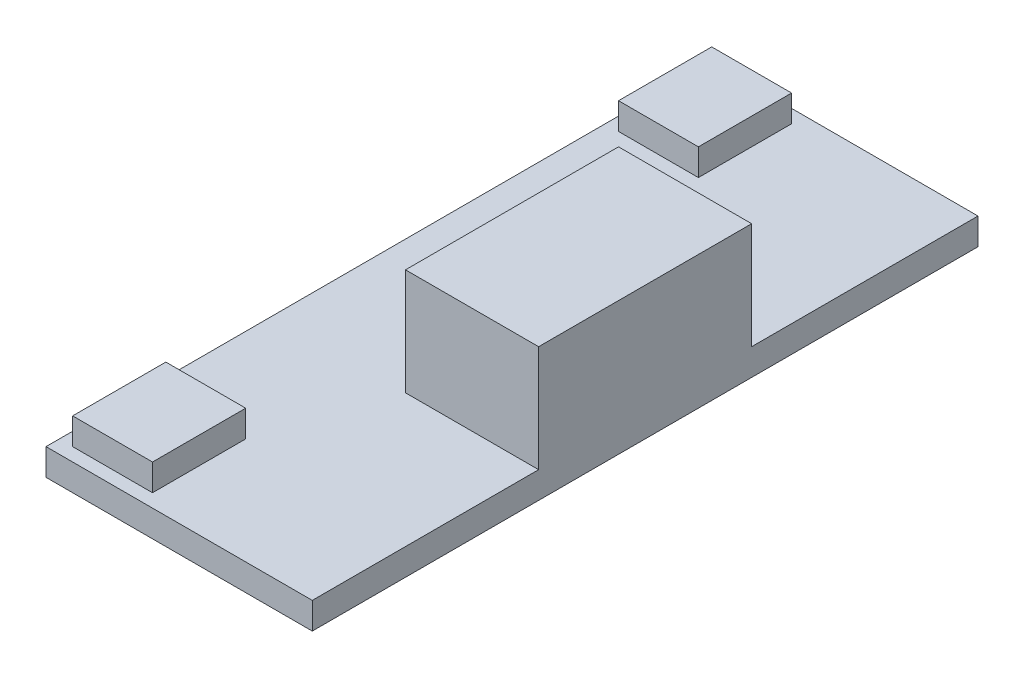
ISO-10303-21;
HEADER;
FILE_DESCRIPTION(('STEP AP214'),'2;1');
FILE_NAME('part.step','',(''),(''),'','','');
FILE_SCHEMA(('AUTOMOTIVE_DESIGN { 1 0 10303 214 1 1 1 1 }'));
ENDSEC;
DATA;
#1=APPLICATION_CONTEXT('core data for automotive mechanical design processes');
#2=APPLICATION_PROTOCOL_DEFINITION('international standard','automotive_design',2000,#1);
#3=PRODUCT_CONTEXT('',#1,'mechanical');
#4=PRODUCT('Part','Part','',(#3));
#5=PRODUCT_RELATED_PRODUCT_CATEGORY('part','',(#4));
#6=PRODUCT_DEFINITION_FORMATION('','',#4);
#7=PRODUCT_DEFINITION_CONTEXT('part definition',#1,'design');
#8=PRODUCT_DEFINITION('design','',#6,#7);
#9=PRODUCT_DEFINITION_SHAPE('','',#8);
#10=(LENGTH_UNIT() NAMED_UNIT(*) SI_UNIT(.MILLI.,.METRE.));
#11=(NAMED_UNIT(*) PLANE_ANGLE_UNIT() SI_UNIT($,.RADIAN.));
#12=(NAMED_UNIT(*) SI_UNIT($,.STERADIAN.) SOLID_ANGLE_UNIT());
#13=UNCERTAINTY_MEASURE_WITH_UNIT(LENGTH_MEASURE(1.E-05),#10,'distance_accuracy_value','');
#14=(GEOMETRIC_REPRESENTATION_CONTEXT(3) GLOBAL_UNCERTAINTY_ASSIGNED_CONTEXT((#13)) GLOBAL_UNIT_ASSIGNED_CONTEXT((#10,
#11,#12)) REPRESENTATION_CONTEXT('',''));
#15=CARTESIAN_POINT('',(0.,0.,0.));
#16=DIRECTION('',(0.,0.,1.));
#17=DIRECTION('',(1.,0.,0.));
#18=AXIS2_PLACEMENT_3D('',#15,#16,#17);
#19=CARTESIAN_POINT('',(0.,1.,0.));
#20=DIRECTION('',(0.,1.,0.));
#21=DIRECTION('',(0.,0.,1.));
#22=AXIS2_PLACEMENT_3D('',#19,#20,#21);
#23=PLANE('',#22);
#24=DIRECTION('',(1.,0.,0.));
#25=VECTOR('',#24,1.);
#26=CARTESIAN_POINT('',(0.,1.,-12.));
#27=LINE('',#26,#25);
#28=CARTESIAN_POINT('',(-4.5,1.,-12.));
#29=VERTEX_POINT('',#28);
#30=CARTESIAN_POINT('',(-1.5,1.,-12.));
#31=VERTEX_POINT('',#30);
#32=EDGE_CURVE('E150',#29,#31,#27,.T.);
#33=ORIENTED_EDGE('',*,*,#32,.T.);
#34=DIRECTION('',(0.,0.,1.));
#35=VECTOR('',#34,1.);
#36=CARTESIAN_POINT('',(-1.5,1.,0.));
#37=LINE('',#36,#35);
#38=CARTESIAN_POINT('',(-1.5,1.,-8.5));
#39=VERTEX_POINT('',#38);
#40=EDGE_CURVE('E166',#31,#39,#37,.T.);
#41=ORIENTED_EDGE('',*,*,#40,.T.);
#42=DIRECTION('',(1.,0.,0.));
#43=VECTOR('',#42,1.);
#44=CARTESIAN_POINT('',(0.,1.,-8.5));
#45=LINE('',#44,#43);
#46=CARTESIAN_POINT('',(-4.5,1.,-8.5));
#47=VERTEX_POINT('',#46);
#48=EDGE_CURVE('E52',#47,#39,#45,.T.);
#49=ORIENTED_EDGE('',*,*,#48,.F.);
#50=DIRECTION('',(0.,0.,1.));
#51=VECTOR('',#50,1.);
#52=CARTESIAN_POINT('',(-4.5,1.,0.));
#53=LINE('',#52,#51);
#54=EDGE_CURVE('E47',#29,#47,#53,.T.);
#55=ORIENTED_EDGE('',*,*,#54,.F.);
#56=EDGE_LOOP('',(#33,#41,#49,#55));
#57=FACE_BOUND('',#56,.T.);
#58=DIRECTION('',(1.,0.,0.));
#59=VECTOR('',#58,1.);
#60=CARTESIAN_POINT('',(0.,1.,4.));
#61=LINE('',#60,#59);
#62=CARTESIAN_POINT('',(0.,1.,4.));
#63=VERTEX_POINT('',#62);
#64=CARTESIAN_POINT('',(5.,1.,4.));
#65=VERTEX_POINT('',#64);
#66=EDGE_CURVE('E213',#63,#65,#61,.T.);
#67=ORIENTED_EDGE('',*,*,#66,.F.);
#68=DIRECTION('',(0.,0.,1.));
#69=VECTOR('',#68,1.);
#70=CARTESIAN_POINT('',(0.,1.,-4.));
#71=LINE('',#70,#69);
#72=CARTESIAN_POINT('',(0.,1.,-4.));
#73=VERTEX_POINT('',#72);
#74=EDGE_CURVE('E217',#73,#63,#71,.T.);
#75=ORIENTED_EDGE('',*,*,#74,.F.);
#76=DIRECTION('',(1.,0.,0.));
#77=VECTOR('',#76,1.);
#78=CARTESIAN_POINT('',(0.,1.,-4.));
#79=LINE('',#78,#77);
#80=CARTESIAN_POINT('',(5.,1.,-4.));
#81=VERTEX_POINT('',#80);
#82=EDGE_CURVE('E228',#73,#81,#79,.T.);
#83=ORIENTED_EDGE('',*,*,#82,.T.);
#84=DIRECTION('',(0.,0.,-1.));
#85=VECTOR('',#84,1.);
#86=CARTESIAN_POINT('',(5.,1.,12.5));
#87=LINE('',#86,#85);
#88=CARTESIAN_POINT('',(5.,1.,-12.5));
#89=VERTEX_POINT('',#88);
#90=EDGE_CURVE('E247',#81,#89,#87,.T.);
#91=ORIENTED_EDGE('',*,*,#90,.T.);
#92=DIRECTION('',(-1.,0.,0.));
#93=VECTOR('',#92,1.);
#94=CARTESIAN_POINT('',(5.,1.,-12.5));
#95=LINE('',#94,#93);
#96=CARTESIAN_POINT('',(-5.,1.,-12.5));
#97=VERTEX_POINT('',#96);
#98=EDGE_CURVE('E251',#89,#97,#95,.T.);
#99=ORIENTED_EDGE('',*,*,#98,.T.);
#100=DIRECTION('',(0.,0.,1.));
#101=VECTOR('',#100,1.);
#102=CARTESIAN_POINT('',(-5.,1.,12.5));
#103=LINE('',#102,#101);
#104=CARTESIAN_POINT('',(-5.,1.,12.5));
#105=VERTEX_POINT('',#104);
#106=EDGE_CURVE('E241',#97,#105,#103,.T.);
#107=ORIENTED_EDGE('',*,*,#106,.T.);
#108=DIRECTION('',(1.,0.,0.));
#109=VECTOR('',#108,1.);
#110=CARTESIAN_POINT('',(5.,1.,12.5));
#111=LINE('',#110,#109);
#112=CARTESIAN_POINT('',(5.,1.,12.5));
#113=VERTEX_POINT('',#112);
#114=EDGE_CURVE('E244',#105,#113,#111,.T.);
#115=ORIENTED_EDGE('',*,*,#114,.T.);
#116=EDGE_CURVE('E248',#113,#65,#87,.T.);
#117=ORIENTED_EDGE('',*,*,#116,.T.);
#118=EDGE_LOOP('',(#67,#75,#83,#91,#99,#107,#115,#117));
#119=FACE_BOUND('',#118,.T.);
#120=DIRECTION('',(0.,0.,-1.));
#121=VECTOR('',#120,1.);
#122=CARTESIAN_POINT('',(-1.5,1.,0.));
#123=LINE('',#122,#121);
#124=CARTESIAN_POINT('',(-1.5,1.,12.));
#125=VERTEX_POINT('',#124);
#126=CARTESIAN_POINT('',(-1.5,1.,8.5));
#127=VERTEX_POINT('',#126);
#128=EDGE_CURVE('E196',#125,#127,#123,.T.);
#129=ORIENTED_EDGE('',*,*,#128,.F.);
#130=DIRECTION('',(1.,0.,0.));
#131=VECTOR('',#130,1.);
#132=CARTESIAN_POINT('',(0.,1.,12.));
#133=LINE('',#132,#131);
#134=CARTESIAN_POINT('',(-4.5,1.,12.));
#135=VERTEX_POINT('',#134);
#136=EDGE_CURVE('E152',#135,#125,#133,.T.);
#137=ORIENTED_EDGE('',*,*,#136,.F.);
#138=DIRECTION('',(0.,0.,-1.));
#139=VECTOR('',#138,1.);
#140=CARTESIAN_POINT('',(-4.5,1.,0.));
#141=LINE('',#140,#139);
#142=CARTESIAN_POINT('',(-4.5,1.,8.5));
#143=VERTEX_POINT('',#142);
#144=EDGE_CURVE('E185',#135,#143,#141,.T.);
#145=ORIENTED_EDGE('',*,*,#144,.T.);
#146=DIRECTION('',(1.,0.,0.));
#147=VECTOR('',#146,1.);
#148=CARTESIAN_POINT('',(0.,1.,8.5));
#149=LINE('',#148,#147);
#150=EDGE_CURVE('E199',#143,#127,#149,.T.);
#151=ORIENTED_EDGE('',*,*,#150,.T.);
#152=EDGE_LOOP('',(#129,#137,#145,#151));
#153=FACE_BOUND('',#152,.T.);
#154=ADVANCED_FACE('F32',(#57,#119,#153),#23,.T.);
#155=CARTESIAN_POINT('',(-5.,1.,12.5));
#156=DIRECTION('',(1.,0.,0.));
#157=DIRECTION('',(0.,0.,-1.));
#158=AXIS2_PLACEMENT_3D('',#155,#156,#157);
#159=PLANE('',#158);
#160=DIRECTION('',(0.,0.,1.));
#161=VECTOR('',#160,1.);
#162=CARTESIAN_POINT('',(-5.,0.,12.5));
#163=LINE('',#162,#161);
#164=CARTESIAN_POINT('',(-5.,0.,-12.5));
#165=VERTEX_POINT('',#164);
#166=CARTESIAN_POINT('',(-5.,0.,12.5));
#167=VERTEX_POINT('',#166);
#168=EDGE_CURVE('E240',#165,#167,#163,.T.);
#169=ORIENTED_EDGE('',*,*,#168,.T.);
#170=DIRECTION('',(0.,-1.,0.));
#171=VECTOR('',#170,1.);
#172=CARTESIAN_POINT('',(-5.,1.,12.5));
#173=LINE('',#172,#171);
#174=EDGE_CURVE('E11',#105,#167,#173,.T.);
#175=ORIENTED_EDGE('',*,*,#174,.F.);
#176=ORIENTED_EDGE('',*,*,#106,.F.);
#177=DIRECTION('',(0.,-1.,0.));
#178=VECTOR('',#177,1.);
#179=CARTESIAN_POINT('',(-5.,1.,-12.5));
#180=LINE('',#179,#178);
#181=EDGE_CURVE('E253',#97,#165,#180,.T.);
#182=ORIENTED_EDGE('',*,*,#181,.T.);
#183=EDGE_LOOP('',(#169,#175,#176,#182));
#184=FACE_BOUND('',#183,.T.);
#185=ADVANCED_FACE('F34',(#184),#159,.F.);
#186=CARTESIAN_POINT('',(5.,1.,12.5));
#187=DIRECTION('',(0.,0.,-1.));
#188=DIRECTION('',(-1.,0.,0.));
#189=AXIS2_PLACEMENT_3D('',#186,#187,#188);
#190=PLANE('',#189);
#191=DIRECTION('',(1.,0.,0.));
#192=VECTOR('',#191,1.);
#193=CARTESIAN_POINT('',(5.,0.,12.5));
#194=LINE('',#193,#192);
#195=CARTESIAN_POINT('',(5.,0.,12.5));
#196=VERTEX_POINT('',#195);
#197=EDGE_CURVE('E256',#167,#196,#194,.T.);
#198=ORIENTED_EDGE('',*,*,#197,.T.);
#199=DIRECTION('',(0.,-1.,0.));
#200=VECTOR('',#199,1.);
#201=CARTESIAN_POINT('',(5.,1.,12.5));
#202=LINE('',#201,#200);
#203=EDGE_CURVE('E40',#113,#196,#202,.T.);
#204=ORIENTED_EDGE('',*,*,#203,.F.);
#205=ORIENTED_EDGE('',*,*,#114,.F.);
#206=ORIENTED_EDGE('',*,*,#174,.T.);
#207=EDGE_LOOP('',(#198,#204,#205,#206));
#208=FACE_BOUND('',#207,.T.);
#209=ADVANCED_FACE('F317',(#208),#190,.F.);
#210=CARTESIAN_POINT('',(5.,1.,12.5));
#211=DIRECTION('',(-1.,0.,0.));
#212=DIRECTION('',(0.,0.,1.));
#213=AXIS2_PLACEMENT_3D('',#210,#211,#212);
#214=PLANE('',#213);
#215=DIRECTION('',(0.,0.,-1.));
#216=VECTOR('',#215,1.);
#217=CARTESIAN_POINT('',(5.,0.,12.5));
#218=LINE('',#217,#216);
#219=CARTESIAN_POINT('',(5.,0.,-12.5));
#220=VERTEX_POINT('',#219);
#221=EDGE_CURVE('E258',#196,#220,#218,.T.);
#222=ORIENTED_EDGE('',*,*,#221,.T.);
#223=DIRECTION('',(0.,-1.,0.));
#224=VECTOR('',#223,1.);
#225=CARTESIAN_POINT('',(5.,1.,-12.5));
#226=LINE('',#225,#224);
#227=EDGE_CURVE('E263',#89,#220,#226,.T.);
#228=ORIENTED_EDGE('',*,*,#227,.F.);
#229=ORIENTED_EDGE('',*,*,#90,.F.);
#230=DIRECTION('',(0.,-1.,0.));
#231=VECTOR('',#230,1.);
#232=CARTESIAN_POINT('',(5.,5.,-4.));
#233=LINE('',#232,#231);
#234=CARTESIAN_POINT('',(5.,5.,-4.));
#235=VERTEX_POINT('',#234);
#236=EDGE_CURVE('E236',#235,#81,#233,.T.);
#237=ORIENTED_EDGE('',*,*,#236,.F.);
#238=DIRECTION('',(0.,0.,1.));
#239=VECTOR('',#238,1.);
#240=CARTESIAN_POINT('',(5.,5.,-4.));
#241=LINE('',#240,#239);
#242=CARTESIAN_POINT('',(5.,5.,4.));
#243=VERTEX_POINT('',#242);
#244=EDGE_CURVE('E216',#235,#243,#241,.T.);
#245=ORIENTED_EDGE('',*,*,#244,.T.);
#246=DIRECTION('',(0.,-1.,0.));
#247=VECTOR('',#246,1.);
#248=CARTESIAN_POINT('',(5.,5.,4.));
#249=LINE('',#248,#247);
#250=EDGE_CURVE('E238',#243,#65,#249,.T.);
#251=ORIENTED_EDGE('',*,*,#250,.T.);
#252=ORIENTED_EDGE('',*,*,#116,.F.);
#253=ORIENTED_EDGE('',*,*,#203,.T.);
#254=EDGE_LOOP('',(#222,#228,#229,#237,#245,#251,#252,#253));
#255=FACE_BOUND('',#254,.T.);
#256=ADVANCED_FACE('F270',(#255),#214,.F.);
#257=CARTESIAN_POINT('',(5.,1.,-12.5));
#258=DIRECTION('',(0.,0.,1.));
#259=DIRECTION('',(1.,0.,0.));
#260=AXIS2_PLACEMENT_3D('',#257,#258,#259);
#261=PLANE('',#260);
#262=DIRECTION('',(-1.,0.,0.));
#263=VECTOR('',#262,1.);
#264=CARTESIAN_POINT('',(5.,0.,-12.5));
#265=LINE('',#264,#263);
#266=EDGE_CURVE('E245',#220,#165,#265,.T.);
#267=ORIENTED_EDGE('',*,*,#266,.T.);
#268=ORIENTED_EDGE('',*,*,#181,.F.);
#269=ORIENTED_EDGE('',*,*,#98,.F.);
#270=ORIENTED_EDGE('',*,*,#227,.T.);
#271=EDGE_LOOP('',(#267,#268,#269,#270));
#272=FACE_BOUND('',#271,.T.);
#273=ADVANCED_FACE('F279',(#272),#261,.F.);
#274=CARTESIAN_POINT('',(0.,0.,0.));
#275=DIRECTION('',(0.,1.,0.));
#276=DIRECTION('',(0.,0.,1.));
#277=AXIS2_PLACEMENT_3D('',#274,#275,#276);
#278=PLANE('',#277);
#279=ORIENTED_EDGE('',*,*,#168,.F.);
#280=ORIENTED_EDGE('',*,*,#266,.F.);
#281=ORIENTED_EDGE('',*,*,#221,.F.);
#282=ORIENTED_EDGE('',*,*,#197,.F.);
#283=EDGE_LOOP('',(#279,#280,#281,#282));
#284=FACE_BOUND('',#283,.T.);
#285=ADVANCED_FACE('F276',(#284),#278,.F.);
#286=CARTESIAN_POINT('',(0.,5.,4.));
#287=DIRECTION('',(0.,0.,-1.));
#288=DIRECTION('',(-1.,0.,0.));
#289=AXIS2_PLACEMENT_3D('',#286,#287,#288);
#290=PLANE('',#289);
#291=ORIENTED_EDGE('',*,*,#66,.T.);
#292=ORIENTED_EDGE('',*,*,#250,.F.);
#293=DIRECTION('',(1.,0.,0.));
#294=VECTOR('',#293,1.);
#295=CARTESIAN_POINT('',(0.,5.,4.));
#296=LINE('',#295,#294);
#297=CARTESIAN_POINT('',(0.,5.,4.));
#298=VERTEX_POINT('',#297);
#299=EDGE_CURVE('E214',#298,#243,#296,.T.);
#300=ORIENTED_EDGE('',*,*,#299,.F.);
#301=DIRECTION('',(0.,-1.,0.));
#302=VECTOR('',#301,1.);
#303=CARTESIAN_POINT('',(0.,5.,4.));
#304=LINE('',#303,#302);
#305=EDGE_CURVE('E225',#298,#63,#304,.T.);
#306=ORIENTED_EDGE('',*,*,#305,.T.);
#307=EDGE_LOOP('',(#291,#292,#300,#306));
#308=FACE_BOUND('',#307,.T.);
#309=ADVANCED_FACE('F303',(#308),#290,.F.);
#310=CARTESIAN_POINT('',(0.,5.,-4.));
#311=DIRECTION('',(0.,0.,-1.));
#312=DIRECTION('',(-1.,0.,0.));
#313=AXIS2_PLACEMENT_3D('',#310,#311,#312);
#314=PLANE('',#313);
#315=ORIENTED_EDGE('',*,*,#82,.F.);
#316=DIRECTION('',(0.,-1.,0.));
#317=VECTOR('',#316,1.);
#318=CARTESIAN_POINT('',(0.,5.,-4.));
#319=LINE('',#318,#317);
#320=CARTESIAN_POINT('',(0.,5.,-4.));
#321=VERTEX_POINT('',#320);
#322=EDGE_CURVE('E234',#321,#73,#319,.T.);
#323=ORIENTED_EDGE('',*,*,#322,.F.);
#324=DIRECTION('',(1.,0.,0.));
#325=VECTOR('',#324,1.);
#326=CARTESIAN_POINT('',(0.,5.,-4.));
#327=LINE('',#326,#325);
#328=EDGE_CURVE('E220',#321,#235,#327,.T.);
#329=ORIENTED_EDGE('',*,*,#328,.T.);
#330=ORIENTED_EDGE('',*,*,#236,.T.);
#331=EDGE_LOOP('',(#315,#323,#329,#330));
#332=FACE_BOUND('',#331,.T.);
#333=ADVANCED_FACE('F297',(#332),#314,.T.);
#334=CARTESIAN_POINT('',(0.,5.,-4.));
#335=DIRECTION('',(1.,0.,0.));
#336=DIRECTION('',(0.,0.,-1.));
#337=AXIS2_PLACEMENT_3D('',#334,#335,#336);
#338=PLANE('',#337);
#339=ORIENTED_EDGE('',*,*,#74,.T.);
#340=ORIENTED_EDGE('',*,*,#305,.F.);
#341=DIRECTION('',(0.,0.,1.));
#342=VECTOR('',#341,1.);
#343=CARTESIAN_POINT('',(0.,5.,-4.));
#344=LINE('',#343,#342);
#345=EDGE_CURVE('E223',#321,#298,#344,.T.);
#346=ORIENTED_EDGE('',*,*,#345,.F.);
#347=ORIENTED_EDGE('',*,*,#322,.T.);
#348=EDGE_LOOP('',(#339,#340,#346,#347));
#349=FACE_BOUND('',#348,.T.);
#350=ADVANCED_FACE('F301',(#349),#338,.F.);
#351=CARTESIAN_POINT('',(0.,5.,0.));
#352=DIRECTION('',(0.,-1.,0.));
#353=DIRECTION('',(0.,0.,-1.));
#354=AXIS2_PLACEMENT_3D('',#351,#352,#353);
#355=PLANE('',#354);
#356=ORIENTED_EDGE('',*,*,#299,.T.);
#357=ORIENTED_EDGE('',*,*,#244,.F.);
#358=ORIENTED_EDGE('',*,*,#328,.F.);
#359=ORIENTED_EDGE('',*,*,#345,.T.);
#360=EDGE_LOOP('',(#356,#357,#358,#359));
#361=FACE_BOUND('',#360,.T.);
#362=ADVANCED_FACE('F294',(#361),#355,.F.);
#363=CARTESIAN_POINT('',(0.,2.,12.));
#364=DIRECTION('',(0.,0.,-1.));
#365=DIRECTION('',(-1.,0.,0.));
#366=AXIS2_PLACEMENT_3D('',#363,#364,#365);
#367=PLANE('',#366);
#368=ORIENTED_EDGE('',*,*,#136,.T.);
#369=DIRECTION('',(0.,-1.,0.));
#370=VECTOR('',#369,1.);
#371=CARTESIAN_POINT('',(-1.5,2.,12.));
#372=LINE('',#371,#370);
#373=CARTESIAN_POINT('',(-1.5,2.,12.));
#374=VERTEX_POINT('',#373);
#375=EDGE_CURVE('E210',#374,#125,#372,.T.);
#376=ORIENTED_EDGE('',*,*,#375,.F.);
#377=DIRECTION('',(1.,0.,0.));
#378=VECTOR('',#377,1.);
#379=CARTESIAN_POINT('',(0.,2.,12.));
#380=LINE('',#379,#378);
#381=CARTESIAN_POINT('',(-4.5,2.,12.));
#382=VERTEX_POINT('',#381);
#383=EDGE_CURVE('E181',#382,#374,#380,.T.);
#384=ORIENTED_EDGE('',*,*,#383,.F.);
#385=DIRECTION('',(0.,-1.,0.));
#386=VECTOR('',#385,1.);
#387=CARTESIAN_POINT('',(-4.5,2.,12.));
#388=LINE('',#387,#386);
#389=EDGE_CURVE('E193',#382,#135,#388,.T.);
#390=ORIENTED_EDGE('',*,*,#389,.T.);
#391=EDGE_LOOP('',(#368,#376,#384,#390));
#392=FACE_BOUND('',#391,.T.);
#393=ADVANCED_FACE('F372',(#392),#367,.F.);
#394=CARTESIAN_POINT('',(-1.5,2.,0.));
#395=DIRECTION('',(-1.,0.,0.));
#396=DIRECTION('',(0.,0.,1.));
#397=AXIS2_PLACEMENT_3D('',#394,#395,#396);
#398=PLANE('',#397);
#399=ORIENTED_EDGE('',*,*,#128,.T.);
#400=DIRECTION('',(0.,-1.,0.));
#401=VECTOR('',#400,1.);
#402=CARTESIAN_POINT('',(-1.5,2.,8.5));
#403=LINE('',#402,#401);
#404=CARTESIAN_POINT('',(-1.5,2.,8.5));
#405=VERTEX_POINT('',#404);
#406=EDGE_CURVE('E207',#405,#127,#403,.T.);
#407=ORIENTED_EDGE('',*,*,#406,.F.);
#408=DIRECTION('',(0.,0.,-1.));
#409=VECTOR('',#408,1.);
#410=CARTESIAN_POINT('',(-1.5,2.,0.));
#411=LINE('',#410,#409);
#412=EDGE_CURVE('E184',#374,#405,#411,.T.);
#413=ORIENTED_EDGE('',*,*,#412,.F.);
#414=ORIENTED_EDGE('',*,*,#375,.T.);
#415=EDGE_LOOP('',(#399,#407,#413,#414));
#416=FACE_BOUND('',#415,.T.);
#417=ADVANCED_FACE('F384',(#416),#398,.F.);
#418=CARTESIAN_POINT('',(0.,2.,8.5));
#419=DIRECTION('',(0.,0.,-1.));
#420=DIRECTION('',(-1.,0.,0.));
#421=AXIS2_PLACEMENT_3D('',#418,#419,#420);
#422=PLANE('',#421);
#423=ORIENTED_EDGE('',*,*,#150,.F.);
#424=DIRECTION('',(0.,-1.,0.));
#425=VECTOR('',#424,1.);
#426=CARTESIAN_POINT('',(-4.5,2.,8.5));
#427=LINE('',#426,#425);
#428=CARTESIAN_POINT('',(-4.5,2.,8.5));
#429=VERTEX_POINT('',#428);
#430=EDGE_CURVE('E204',#429,#143,#427,.T.);
#431=ORIENTED_EDGE('',*,*,#430,.F.);
#432=DIRECTION('',(1.,0.,0.));
#433=VECTOR('',#432,1.);
#434=CARTESIAN_POINT('',(0.,2.,8.5));
#435=LINE('',#434,#433);
#436=EDGE_CURVE('E187',#429,#405,#435,.T.);
#437=ORIENTED_EDGE('',*,*,#436,.T.);
#438=ORIENTED_EDGE('',*,*,#406,.T.);
#439=EDGE_LOOP('',(#423,#431,#437,#438));
#440=FACE_BOUND('',#439,.T.);
#441=ADVANCED_FACE('F393',(#440),#422,.T.);
#442=CARTESIAN_POINT('',(-4.5,2.,0.));
#443=DIRECTION('',(-1.,0.,0.));
#444=DIRECTION('',(0.,0.,1.));
#445=AXIS2_PLACEMENT_3D('',#442,#443,#444);
#446=PLANE('',#445);
#447=ORIENTED_EDGE('',*,*,#144,.F.);
#448=ORIENTED_EDGE('',*,*,#389,.F.);
#449=DIRECTION('',(0.,0.,-1.));
#450=VECTOR('',#449,1.);
#451=CARTESIAN_POINT('',(-4.5,2.,0.));
#452=LINE('',#451,#450);
#453=EDGE_CURVE('E190',#382,#429,#452,.T.);
#454=ORIENTED_EDGE('',*,*,#453,.T.);
#455=ORIENTED_EDGE('',*,*,#430,.T.);
#456=EDGE_LOOP('',(#447,#448,#454,#455));
#457=FACE_BOUND('',#456,.T.);
#458=ADVANCED_FACE('F402',(#457),#446,.T.);
#459=CARTESIAN_POINT('',(0.,2.,0.));
#460=DIRECTION('',(0.,1.,0.));
#461=DIRECTION('',(0.,0.,1.));
#462=AXIS2_PLACEMENT_3D('',#459,#460,#461);
#463=PLANE('',#462);
#464=ORIENTED_EDGE('',*,*,#383,.T.);
#465=ORIENTED_EDGE('',*,*,#412,.T.);
#466=ORIENTED_EDGE('',*,*,#436,.F.);
#467=ORIENTED_EDGE('',*,*,#453,.F.);
#468=EDGE_LOOP('',(#464,#465,#466,#467));
#469=FACE_BOUND('',#468,.T.);
#470=ADVANCED_FACE('F411',(#469),#463,.T.);
#471=CARTESIAN_POINT('',(0.,2.,-12.));
#472=DIRECTION('',(0.,0.,-1.));
#473=DIRECTION('',(-1.,0.,0.));
#474=AXIS2_PLACEMENT_3D('',#471,#472,#473);
#475=PLANE('',#474);
#476=ORIENTED_EDGE('',*,*,#32,.F.);
#477=DIRECTION('',(0.,-1.,0.));
#478=VECTOR('',#477,1.);
#479=CARTESIAN_POINT('',(-4.5,2.,-12.));
#480=LINE('',#479,#478);
#481=CARTESIAN_POINT('',(-4.5,2.,-12.));
#482=VERTEX_POINT('',#481);
#483=EDGE_CURVE('E143',#482,#29,#480,.T.);
#484=ORIENTED_EDGE('',*,*,#483,.F.);
#485=DIRECTION('',(1.,0.,0.));
#486=VECTOR('',#485,1.);
#487=CARTESIAN_POINT('',(0.,2.,-12.));
#488=LINE('',#487,#486);
#489=CARTESIAN_POINT('',(-1.5,2.,-12.));
#490=VERTEX_POINT('',#489);
#491=EDGE_CURVE('E148',#482,#490,#488,.T.);
#492=ORIENTED_EDGE('',*,*,#491,.T.);
#493=DIRECTION('',(0.,-1.,0.));
#494=VECTOR('',#493,1.);
#495=CARTESIAN_POINT('',(-1.5,2.,-12.));
#496=LINE('',#495,#494);
#497=EDGE_CURVE('E172',#490,#31,#496,.T.);
#498=ORIENTED_EDGE('',*,*,#497,.T.);
#499=EDGE_LOOP('',(#476,#484,#492,#498));
#500=FACE_BOUND('',#499,.T.);
#501=ADVANCED_FACE('F145',(#500),#475,.T.);
#502=CARTESIAN_POINT('',(-4.5,2.,0.));
#503=DIRECTION('',(1.,0.,0.));
#504=DIRECTION('',(0.,0.,-1.));
#505=AXIS2_PLACEMENT_3D('',#502,#503,#504);
#506=PLANE('',#505);
#507=ORIENTED_EDGE('',*,*,#54,.T.);
#508=DIRECTION('',(0.,-1.,0.));
#509=VECTOR('',#508,1.);
#510=CARTESIAN_POINT('',(-4.5,2.,-8.5));
#511=LINE('',#510,#509);
#512=CARTESIAN_POINT('',(-4.5,2.,-8.5));
#513=VERTEX_POINT('',#512);
#514=EDGE_CURVE('E153',#513,#47,#511,.T.);
#515=ORIENTED_EDGE('',*,*,#514,.F.);
#516=DIRECTION('',(0.,0.,1.));
#517=VECTOR('',#516,1.);
#518=CARTESIAN_POINT('',(-4.5,2.,0.));
#519=LINE('',#518,#517);
#520=EDGE_CURVE('E156',#482,#513,#519,.T.);
#521=ORIENTED_EDGE('',*,*,#520,.F.);
#522=ORIENTED_EDGE('',*,*,#483,.T.);
#523=EDGE_LOOP('',(#507,#515,#521,#522));
#524=FACE_BOUND('',#523,.T.);
#525=ADVANCED_FACE('F157',(#524),#506,.F.);
#526=CARTESIAN_POINT('',(0.,2.,-8.5));
#527=DIRECTION('',(0.,0.,-1.));
#528=DIRECTION('',(-1.,0.,0.));
#529=AXIS2_PLACEMENT_3D('',#526,#527,#528);
#530=PLANE('',#529);
#531=ORIENTED_EDGE('',*,*,#48,.T.);
#532=DIRECTION('',(0.,-1.,0.));
#533=VECTOR('',#532,1.);
#534=CARTESIAN_POINT('',(-1.5,2.,-8.5));
#535=LINE('',#534,#533);
#536=CARTESIAN_POINT('',(-1.5,2.,-8.5));
#537=VERTEX_POINT('',#536);
#538=EDGE_CURVE('E177',#537,#39,#535,.T.);
#539=ORIENTED_EDGE('',*,*,#538,.F.);
#540=DIRECTION('',(1.,0.,0.));
#541=VECTOR('',#540,1.);
#542=CARTESIAN_POINT('',(0.,2.,-8.5));
#543=LINE('',#542,#541);
#544=EDGE_CURVE('E161',#513,#537,#543,.T.);
#545=ORIENTED_EDGE('',*,*,#544,.F.);
#546=ORIENTED_EDGE('',*,*,#514,.T.);
#547=EDGE_LOOP('',(#531,#539,#545,#546));
#548=FACE_BOUND('',#547,.T.);
#549=ADVANCED_FACE('F435',(#548),#530,.F.);
#550=CARTESIAN_POINT('',(-1.5,2.,0.));
#551=DIRECTION('',(1.,0.,0.));
#552=DIRECTION('',(0.,0.,-1.));
#553=AXIS2_PLACEMENT_3D('',#550,#551,#552);
#554=PLANE('',#553);
#555=ORIENTED_EDGE('',*,*,#40,.F.);
#556=ORIENTED_EDGE('',*,*,#497,.F.);
#557=DIRECTION('',(0.,0.,1.));
#558=VECTOR('',#557,1.);
#559=CARTESIAN_POINT('',(-1.5,2.,0.));
#560=LINE('',#559,#558);
#561=EDGE_CURVE('E165',#490,#537,#560,.T.);
#562=ORIENTED_EDGE('',*,*,#561,.T.);
#563=ORIENTED_EDGE('',*,*,#538,.T.);
#564=EDGE_LOOP('',(#555,#556,#562,#563));
#565=FACE_BOUND('',#564,.T.);
#566=ADVANCED_FACE('F443',(#565),#554,.T.);
#567=CARTESIAN_POINT('',(0.,2.,0.));
#568=DIRECTION('',(0.,1.,0.));
#569=DIRECTION('',(0.,0.,1.));
#570=AXIS2_PLACEMENT_3D('',#567,#568,#569);
#571=PLANE('',#570);
#572=ORIENTED_EDGE('',*,*,#491,.F.);
#573=ORIENTED_EDGE('',*,*,#520,.T.);
#574=ORIENTED_EDGE('',*,*,#544,.T.);
#575=ORIENTED_EDGE('',*,*,#561,.F.);
#576=EDGE_LOOP('',(#572,#573,#574,#575));
#577=FACE_BOUND('',#576,.T.);
#578=ADVANCED_FACE('F163',(#577),#571,.T.);
#579=CLOSED_SHELL('',(#154,#185,#209,#256,#273,#285,#309,#333,#350,#362,#393,#417,#441,#458,
#470,#501,#525,#549,#566,#578));
#580=MANIFOLD_SOLID_BREP('B2',#579);
#581=ADVANCED_BREP_SHAPE_REPRESENTATION('',(#18,#580),#14);
#582=SHAPE_DEFINITION_REPRESENTATION(#9,#581);
ENDSEC;
END-ISO-10303-21;
